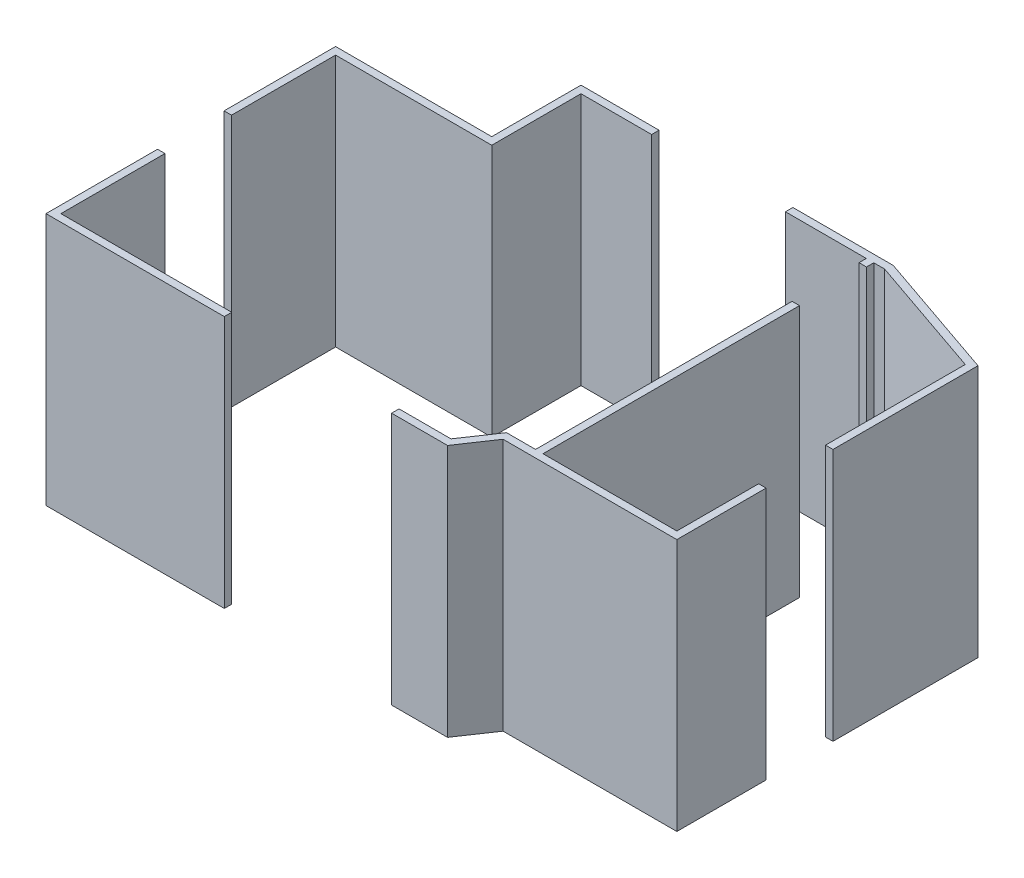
ISO-10303-21;
HEADER;
FILE_DESCRIPTION(('STEP AP214'),'2;1');
FILE_NAME('part.step','',(''),(''),'','','');
FILE_SCHEMA(('AUTOMOTIVE_DESIGN { 1 0 10303 214 1 1 1 1 }'));
ENDSEC;
DATA;
#1=APPLICATION_CONTEXT('core data for automotive mechanical design processes');
#2=APPLICATION_PROTOCOL_DEFINITION('international standard','automotive_design',2000,#1);
#3=PRODUCT_CONTEXT('',#1,'mechanical');
#4=PRODUCT('Part','Part','',(#3));
#5=PRODUCT_RELATED_PRODUCT_CATEGORY('part','',(#4));
#6=PRODUCT_DEFINITION_FORMATION('','',#4);
#7=PRODUCT_DEFINITION_CONTEXT('part definition',#1,'design');
#8=PRODUCT_DEFINITION('design','',#6,#7);
#9=PRODUCT_DEFINITION_SHAPE('','',#8);
#10=(LENGTH_UNIT() NAMED_UNIT(*) SI_UNIT(.MILLI.,.METRE.));
#11=(NAMED_UNIT(*) PLANE_ANGLE_UNIT() SI_UNIT($,.RADIAN.));
#12=(NAMED_UNIT(*) SI_UNIT($,.STERADIAN.) SOLID_ANGLE_UNIT());
#13=UNCERTAINTY_MEASURE_WITH_UNIT(LENGTH_MEASURE(1.E-05),#10,'distance_accuracy_value','');
#14=(GEOMETRIC_REPRESENTATION_CONTEXT(3) GLOBAL_UNCERTAINTY_ASSIGNED_CONTEXT((#13)) GLOBAL_UNIT_ASSIGNED_CONTEXT((#10,
#11,#12)) REPRESENTATION_CONTEXT('',''));
#15=CARTESIAN_POINT('',(0.,0.,0.));
#16=DIRECTION('',(0.,0.,1.));
#17=DIRECTION('',(1.,0.,0.));
#18=AXIS2_PLACEMENT_3D('',#15,#16,#17);
#19=CARTESIAN_POINT('',(0.,2997.2,0.));
#20=DIRECTION('',(1.,0.,0.));
#21=DIRECTION('',(0.,0.,-1.));
#22=AXIS2_PLACEMENT_3D('',#19,#20,#21);
#23=PLANE('',#22);
#24=DIRECTION('',(0.,-1.,0.));
#25=VECTOR('',#24,1.);
#26=CARTESIAN_POINT('',(0.,2997.2,-1524.));
#27=LINE('',#26,#25);
#28=CARTESIAN_POINT('',(0.,2997.2,-1524.));
#29=VERTEX_POINT('',#28);
#30=CARTESIAN_POINT('',(0.,-457.2,-1524.));
#31=VERTEX_POINT('',#30);
#32=EDGE_CURVE('E128',#29,#31,#27,.T.);
#33=ORIENTED_EDGE('',*,*,#32,.T.);
#34=DIRECTION('',(0.,0.,1.));
#35=VECTOR('',#34,1.);
#36=CARTESIAN_POINT('',(0.,-457.2,-1524.));
#37=LINE('',#36,#35);
#38=CARTESIAN_POINT('',(0.,-457.2,0.));
#39=VERTEX_POINT('',#38);
#40=EDGE_CURVE('E120',#31,#39,#37,.T.);
#41=ORIENTED_EDGE('',*,*,#40,.T.);
#42=DIRECTION('',(0.,-1.,0.));
#43=VECTOR('',#42,1.);
#44=CARTESIAN_POINT('',(0.,2997.2,0.));
#45=LINE('',#44,#43);
#46=CARTESIAN_POINT('',(0.,2997.2,0.));
#47=VERTEX_POINT('',#46);
#48=EDGE_CURVE('E106',#47,#39,#45,.T.);
#49=ORIENTED_EDGE('',*,*,#48,.F.);
#50=DIRECTION('',(0.,0.,1.));
#51=VECTOR('',#50,1.);
#52=CARTESIAN_POINT('',(0.,2997.2,0.));
#53=LINE('',#52,#51);
#54=EDGE_CURVE('E146',#29,#47,#53,.T.);
#55=ORIENTED_EDGE('',*,*,#54,.F.);
#56=EDGE_LOOP('',(#33,#41,#49,#55));
#57=FACE_BOUND('',#56,.T.);
#58=ADVANCED_FACE('F53',(#57),#23,.F.);
#59=CARTESIAN_POINT('',(0.,2997.2,0.));
#60=DIRECTION('',(0.,0.,-1.));
#61=DIRECTION('',(-1.,0.,0.));
#62=AXIS2_PLACEMENT_3D('',#59,#60,#61);
#63=PLANE('',#62);
#64=DIRECTION('',(0.,-1.,0.));
#65=VECTOR('',#64,1.);
#66=CARTESIAN_POINT('',(2435.961,2997.2,0.));
#67=LINE('',#66,#65);
#68=CARTESIAN_POINT('',(2435.961,2997.2,0.));
#69=VERTEX_POINT('',#68);
#70=CARTESIAN_POINT('',(2435.961,-457.2,0.));
#71=VERTEX_POINT('',#70);
#72=EDGE_CURVE('E113',#69,#71,#67,.T.);
#73=ORIENTED_EDGE('',*,*,#72,.F.);
#74=DIRECTION('',(-1.,0.,0.));
#75=VECTOR('',#74,1.);
#76=CARTESIAN_POINT('',(0.,2997.2,0.));
#77=LINE('',#76,#75);
#78=EDGE_CURVE('E70',#69,#47,#77,.T.);
#79=ORIENTED_EDGE('',*,*,#78,.T.);
#80=ORIENTED_EDGE('',*,*,#48,.T.);
#81=DIRECTION('',(1.,0.,0.));
#82=VECTOR('',#81,1.);
#83=CARTESIAN_POINT('',(0.,-457.2,0.));
#84=LINE('',#83,#82);
#85=EDGE_CURVE('E108',#39,#71,#84,.T.);
#86=ORIENTED_EDGE('',*,*,#85,.T.);
#87=EDGE_LOOP('',(#73,#79,#80,#86));
#88=FACE_BOUND('',#87,.T.);
#89=ADVANCED_FACE('F55',(#88),#63,.F.);
#90=CARTESIAN_POINT('',(2435.961,2997.2,-101.6));
#91=DIRECTION('',(-1.,0.,0.));
#92=DIRECTION('',(0.,0.,1.));
#93=AXIS2_PLACEMENT_3D('',#90,#91,#92);
#94=PLANE('',#93);
#95=ORIENTED_EDGE('',*,*,#72,.T.);
#96=DIRECTION('',(0.,0.,-1.));
#97=VECTOR('',#96,1.);
#98=CARTESIAN_POINT('',(2435.961,-457.2,0.));
#99=LINE('',#98,#97);
#100=CARTESIAN_POINT('',(2435.961,-457.2,-101.6));
#101=VERTEX_POINT('',#100);
#102=EDGE_CURVE('E124',#71,#101,#99,.T.);
#103=ORIENTED_EDGE('',*,*,#102,.T.);
#104=DIRECTION('',(0.,-1.,0.));
#105=VECTOR('',#104,1.);
#106=CARTESIAN_POINT('',(2435.961,2997.2,-101.6));
#107=LINE('',#106,#105);
#108=CARTESIAN_POINT('',(2435.961,2997.2,-101.6));
#109=VERTEX_POINT('',#108);
#110=EDGE_CURVE('E150',#109,#101,#107,.T.);
#111=ORIENTED_EDGE('',*,*,#110,.F.);
#112=DIRECTION('',(0.,0.,-1.));
#113=VECTOR('',#112,1.);
#114=CARTESIAN_POINT('',(2435.961,2997.2,-101.6));
#115=LINE('',#114,#113);
#116=EDGE_CURVE('E144',#69,#109,#115,.T.);
#117=ORIENTED_EDGE('',*,*,#116,.F.);
#118=EDGE_LOOP('',(#95,#103,#111,#117));
#119=FACE_BOUND('',#118,.T.);
#120=ADVANCED_FACE('F179',(#119),#94,.F.);
#121=CARTESIAN_POINT('',(101.6,2997.2,-101.6));
#122=DIRECTION('',(0.,0.,1.));
#123=DIRECTION('',(1.,0.,0.));
#124=AXIS2_PLACEMENT_3D('',#121,#122,#123);
#125=PLANE('',#124);
#126=ORIENTED_EDGE('',*,*,#110,.T.);
#127=DIRECTION('',(-1.,0.,0.));
#128=VECTOR('',#127,1.);
#129=CARTESIAN_POINT('',(2435.961,-457.2,-101.6));
#130=LINE('',#129,#128);
#131=CARTESIAN_POINT('',(101.6,-457.2,-101.6));
#132=VERTEX_POINT('',#131);
#133=EDGE_CURVE('E133',#101,#132,#130,.T.);
#134=ORIENTED_EDGE('',*,*,#133,.T.);
#135=DIRECTION('',(0.,-1.,0.));
#136=VECTOR('',#135,1.);
#137=CARTESIAN_POINT('',(101.6,2997.2,-101.6));
#138=LINE('',#137,#136);
#139=CARTESIAN_POINT('',(101.6,2997.2,-101.6));
#140=VERTEX_POINT('',#139);
#141=EDGE_CURVE('E154',#140,#132,#138,.T.);
#142=ORIENTED_EDGE('',*,*,#141,.F.);
#143=DIRECTION('',(-1.,0.,0.));
#144=VECTOR('',#143,1.);
#145=CARTESIAN_POINT('',(101.6,2997.2,-101.6));
#146=LINE('',#145,#144);
#147=EDGE_CURVE('E63',#109,#140,#146,.T.);
#148=ORIENTED_EDGE('',*,*,#147,.F.);
#149=EDGE_LOOP('',(#126,#134,#142,#148));
#150=FACE_BOUND('',#149,.T.);
#151=ADVANCED_FACE('F174',(#150),#125,.F.);
#152=CARTESIAN_POINT('',(101.6,2997.2,-101.6));
#153=DIRECTION('',(-1.,0.,0.));
#154=DIRECTION('',(0.,0.,1.));
#155=AXIS2_PLACEMENT_3D('',#152,#153,#154);
#156=PLANE('',#155);
#157=ORIENTED_EDGE('',*,*,#141,.T.);
#158=DIRECTION('',(0.,0.,-1.));
#159=VECTOR('',#158,1.);
#160=CARTESIAN_POINT('',(101.6,-457.2,-101.6));
#161=LINE('',#160,#159);
#162=CARTESIAN_POINT('',(101.6,-457.2,-1524.));
#163=VERTEX_POINT('',#162);
#164=EDGE_CURVE('E137',#132,#163,#161,.T.);
#165=ORIENTED_EDGE('',*,*,#164,.T.);
#166=DIRECTION('',(0.,-1.,0.));
#167=VECTOR('',#166,1.);
#168=CARTESIAN_POINT('',(101.6,2997.2,-1524.));
#169=LINE('',#168,#167);
#170=CARTESIAN_POINT('',(101.6,2997.2,-1524.));
#171=VERTEX_POINT('',#170);
#172=EDGE_CURVE('E157',#171,#163,#169,.T.);
#173=ORIENTED_EDGE('',*,*,#172,.F.);
#174=DIRECTION('',(0.,0.,-1.));
#175=VECTOR('',#174,1.);
#176=CARTESIAN_POINT('',(101.6,2997.2,-101.6));
#177=LINE('',#176,#175);
#178=EDGE_CURVE('E12',#140,#171,#177,.T.);
#179=ORIENTED_EDGE('',*,*,#178,.F.);
#180=EDGE_LOOP('',(#157,#165,#173,#179));
#181=FACE_BOUND('',#180,.T.);
#182=ADVANCED_FACE('F186',(#181),#156,.F.);
#183=CARTESIAN_POINT('',(101.6,2997.2,-1524.));
#184=DIRECTION('',(0.,0.,1.));
#185=DIRECTION('',(1.,0.,0.));
#186=AXIS2_PLACEMENT_3D('',#183,#184,#185);
#187=PLANE('',#186);
#188=ORIENTED_EDGE('',*,*,#172,.T.);
#189=DIRECTION('',(-1.,0.,0.));
#190=VECTOR('',#189,1.);
#191=CARTESIAN_POINT('',(101.6,-457.2,-1524.));
#192=LINE('',#191,#190);
#193=EDGE_CURVE('E140',#163,#31,#192,.T.);
#194=ORIENTED_EDGE('',*,*,#193,.T.);
#195=ORIENTED_EDGE('',*,*,#32,.F.);
#196=DIRECTION('',(-1.,0.,0.));
#197=VECTOR('',#196,1.);
#198=CARTESIAN_POINT('',(101.6,2997.2,-1524.));
#199=LINE('',#198,#197);
#200=EDGE_CURVE('E160',#171,#29,#199,.T.);
#201=ORIENTED_EDGE('',*,*,#200,.F.);
#202=EDGE_LOOP('',(#188,#194,#195,#201));
#203=FACE_BOUND('',#202,.T.);
#204=ADVANCED_FACE('F169',(#203),#187,.F.);
#205=CARTESIAN_POINT('',(0.,2997.2,-1524.));
#206=DIRECTION('',(0.,1.,0.));
#207=DIRECTION('',(0.,0.,1.));
#208=AXIS2_PLACEMENT_3D('',#205,#206,#207);
#209=PLANE('',#208);
#210=ORIENTED_EDGE('',*,*,#54,.T.);
#211=ORIENTED_EDGE('',*,*,#78,.F.);
#212=ORIENTED_EDGE('',*,*,#116,.T.);
#213=ORIENTED_EDGE('',*,*,#147,.T.);
#214=ORIENTED_EDGE('',*,*,#178,.T.);
#215=ORIENTED_EDGE('',*,*,#200,.T.);
#216=EDGE_LOOP('',(#210,#211,#212,#213,#214,#215));
#217=FACE_BOUND('',#216,.T.);
#218=ADVANCED_FACE('F165',(#217),#209,.T.);
#219=CARTESIAN_POINT('',(0.,-457.2,0.));
#220=DIRECTION('',(0.,1.,0.));
#221=DIRECTION('',(0.,0.,1.));
#222=AXIS2_PLACEMENT_3D('',#219,#220,#221);
#223=PLANE('',#222);
#224=ORIENTED_EDGE('',*,*,#40,.F.);
#225=ORIENTED_EDGE('',*,*,#193,.F.);
#226=ORIENTED_EDGE('',*,*,#164,.F.);
#227=ORIENTED_EDGE('',*,*,#133,.F.);
#228=ORIENTED_EDGE('',*,*,#102,.F.);
#229=ORIENTED_EDGE('',*,*,#85,.F.);
#230=EDGE_LOOP('',(#224,#225,#226,#227,#228,#229));
#231=FACE_BOUND('',#230,.T.);
#232=ADVANCED_FACE('F118',(#231),#223,.F.);
#233=CLOSED_SHELL('',(#58,#89,#120,#151,#182,#204,#218,#232));
#234=MANIFOLD_SOLID_BREP('B2',#233);
#235=CARTESIAN_POINT('',(3201.08661579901,2997.2,-5073.74060592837));
#236=DIRECTION('',(0.,0.,-1.));
#237=DIRECTION('',(-1.,0.,0.));
#238=AXIS2_PLACEMENT_3D('',#235,#236,#237);
#239=PLANE('',#238);
#240=DIRECTION('',(0.,-1.,0.));
#241=VECTOR('',#240,1.);
#242=CARTESIAN_POINT('',(2235.88661579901,2997.2,-5073.74060592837));
#243=LINE('',#242,#241);
#244=CARTESIAN_POINT('',(2235.88661579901,2997.2,-5073.74060592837));
#245=VERTEX_POINT('',#244);
#246=CARTESIAN_POINT('',(2235.88661579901,-457.2,-5073.74060592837));
#247=VERTEX_POINT('',#246);
#248=EDGE_CURVE('E344',#245,#247,#243,.T.);
#249=ORIENTED_EDGE('',*,*,#248,.T.);
#250=DIRECTION('',(1.,0.,0.));
#251=VECTOR('',#250,1.);
#252=CARTESIAN_POINT('',(2235.88661579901,-457.2,-5073.74060592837));
#253=LINE('',#252,#251);
#254=CARTESIAN_POINT('',(3201.08661579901,-457.2,-5073.74060592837));
#255=VERTEX_POINT('',#254);
#256=EDGE_CURVE('E421',#247,#255,#253,.T.);
#257=ORIENTED_EDGE('',*,*,#256,.T.);
#258=DIRECTION('',(0.,-1.,0.));
#259=VECTOR('',#258,1.);
#260=CARTESIAN_POINT('',(3201.08661579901,2997.2,-5073.74060592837));
#261=LINE('',#260,#259);
#262=CARTESIAN_POINT('',(3201.08661579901,2997.2,-5073.74060592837));
#263=VERTEX_POINT('',#262);
#264=EDGE_CURVE('E357',#263,#255,#261,.T.);
#265=ORIENTED_EDGE('',*,*,#264,.F.);
#266=DIRECTION('',(1.,0.,0.));
#267=VECTOR('',#266,1.);
#268=CARTESIAN_POINT('',(3201.08661579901,2997.2,-5073.74060592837));
#269=LINE('',#268,#267);
#270=EDGE_CURVE('E300',#245,#263,#269,.T.);
#271=ORIENTED_EDGE('',*,*,#270,.F.);
#272=EDGE_LOOP('',(#249,#257,#265,#271));
#273=FACE_BOUND('',#272,.T.);
#274=ADVANCED_FACE('F290',(#273),#239,.F.);
#275=CARTESIAN_POINT('',(2235.88661579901,2997.2,-5073.74060592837));
#276=DIRECTION('',(-1.,0.,0.));
#277=DIRECTION('',(0.,0.,1.));
#278=AXIS2_PLACEMENT_3D('',#275,#276,#277);
#279=PLANE('',#278);
#280=DIRECTION('',(0.,-1.,0.));
#281=VECTOR('',#280,1.);
#282=CARTESIAN_POINT('',(2235.88661579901,2997.2,-3854.54060592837));
#283=LINE('',#282,#281);
#284=CARTESIAN_POINT('',(2235.88661579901,2997.2,-3854.54060592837));
#285=VERTEX_POINT('',#284);
#286=CARTESIAN_POINT('',(2235.88661579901,-457.2,-3854.54060592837));
#287=VERTEX_POINT('',#286);
#288=EDGE_CURVE('E353',#285,#287,#283,.T.);
#289=ORIENTED_EDGE('',*,*,#288,.T.);
#290=DIRECTION('',(0.,0.,-1.));
#291=VECTOR('',#290,1.);
#292=CARTESIAN_POINT('',(2235.88661579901,-457.2,-3854.54060592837));
#293=LINE('',#292,#291);
#294=EDGE_CURVE('E348',#287,#247,#293,.T.);
#295=ORIENTED_EDGE('',*,*,#294,.T.);
#296=ORIENTED_EDGE('',*,*,#248,.F.);
#297=DIRECTION('',(0.,0.,-1.));
#298=VECTOR('',#297,1.);
#299=CARTESIAN_POINT('',(2235.88661579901,2997.2,-5073.74060592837));
#300=LINE('',#299,#298);
#301=EDGE_CURVE('E334',#285,#245,#300,.T.);
#302=ORIENTED_EDGE('',*,*,#301,.F.);
#303=EDGE_LOOP('',(#289,#295,#296,#302));
#304=FACE_BOUND('',#303,.T.);
#305=ADVANCED_FACE('F345',(#304),#279,.F.);
#306=CARTESIAN_POINT('',(2235.88661579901,2997.2,-3854.54060592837));
#307=DIRECTION('',(0.,0.,-1.));
#308=DIRECTION('',(-1.,0.,0.));
#309=AXIS2_PLACEMENT_3D('',#306,#307,#308);
#310=PLANE('',#309);
#311=DIRECTION('',(0.,-1.,0.));
#312=VECTOR('',#311,1.);
#313=CARTESIAN_POINT('',(102.286615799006,2997.2,-3854.54060592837));
#314=LINE('',#313,#312);
#315=CARTESIAN_POINT('',(102.286615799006,2997.2,-3854.54060592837));
#316=VERTEX_POINT('',#315);
#317=CARTESIAN_POINT('',(102.286615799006,-457.2,-3854.54060592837));
#318=VERTEX_POINT('',#317);
#319=EDGE_CURVE('E405',#316,#318,#314,.T.);
#320=ORIENTED_EDGE('',*,*,#319,.T.);
#321=DIRECTION('',(1.,0.,0.));
#322=VECTOR('',#321,1.);
#323=CARTESIAN_POINT('',(102.286615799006,-457.2,-3854.54060592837));
#324=LINE('',#323,#322);
#325=EDGE_CURVE('E419',#318,#287,#324,.T.);
#326=ORIENTED_EDGE('',*,*,#325,.T.);
#327=ORIENTED_EDGE('',*,*,#288,.F.);
#328=DIRECTION('',(1.,0.,0.));
#329=VECTOR('',#328,1.);
#330=CARTESIAN_POINT('',(2235.88661579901,2997.2,-3854.54060592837));
#331=LINE('',#330,#329);
#332=EDGE_CURVE('E337',#316,#285,#331,.T.);
#333=ORIENTED_EDGE('',*,*,#332,.F.);
#334=EDGE_LOOP('',(#320,#326,#327,#333));
#335=FACE_BOUND('',#334,.T.);
#336=ADVANCED_FACE('F424',(#335),#310,.F.);
#337=CARTESIAN_POINT('',(102.286615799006,2997.2,-3854.54060592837));
#338=DIRECTION('',(-1.,0.,0.));
#339=DIRECTION('',(0.,0.,1.));
#340=AXIS2_PLACEMENT_3D('',#337,#338,#339);
#341=PLANE('',#340);
#342=DIRECTION('',(0.,-1.,0.));
#343=VECTOR('',#342,1.);
#344=CARTESIAN_POINT('',(102.286615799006,2997.2,-2432.14060592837));
#345=LINE('',#344,#343);
#346=CARTESIAN_POINT('',(102.286615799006,2997.2,-2432.14060592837));
#347=VERTEX_POINT('',#346);
#348=CARTESIAN_POINT('',(102.286615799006,-457.2,-2432.14060592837));
#349=VERTEX_POINT('',#348);
#350=EDGE_CURVE('E398',#347,#349,#345,.T.);
#351=ORIENTED_EDGE('',*,*,#350,.T.);
#352=DIRECTION('',(0.,0.,-1.));
#353=VECTOR('',#352,1.);
#354=CARTESIAN_POINT('',(102.286615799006,-457.2,-2432.14060592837));
#355=LINE('',#354,#353);
#356=EDGE_CURVE('E427',#349,#318,#355,.T.);
#357=ORIENTED_EDGE('',*,*,#356,.T.);
#358=ORIENTED_EDGE('',*,*,#319,.F.);
#359=DIRECTION('',(0.,0.,-1.));
#360=VECTOR('',#359,1.);
#361=CARTESIAN_POINT('',(102.286615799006,2997.2,-3854.54060592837));
#362=LINE('',#361,#360);
#363=EDGE_CURVE('E363',#347,#316,#362,.T.);
#364=ORIENTED_EDGE('',*,*,#363,.F.);
#365=EDGE_LOOP('',(#351,#357,#358,#364));
#366=FACE_BOUND('',#365,.T.);
#367=ADVANCED_FACE('F525',(#366),#341,.F.);
#368=CARTESIAN_POINT('',(0.686615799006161,2997.2,-2432.14060592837));
#369=DIRECTION('',(0.,0.,-1.));
#370=DIRECTION('',(-1.,0.,0.));
#371=AXIS2_PLACEMENT_3D('',#368,#369,#370);
#372=PLANE('',#371);
#373=DIRECTION('',(0.,-1.,0.));
#374=VECTOR('',#373,1.);
#375=CARTESIAN_POINT('',(0.686615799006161,2997.2,-2432.14060592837));
#376=LINE('',#375,#374);
#377=CARTESIAN_POINT('',(0.686615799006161,2997.2,-2432.14060592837));
#378=VERTEX_POINT('',#377);
#379=CARTESIAN_POINT('',(0.686615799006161,-457.2,-2432.14060592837));
#380=VERTEX_POINT('',#379);
#381=EDGE_CURVE('E390',#378,#380,#376,.T.);
#382=ORIENTED_EDGE('',*,*,#381,.T.);
#383=DIRECTION('',(1.,0.,0.));
#384=VECTOR('',#383,1.);
#385=CARTESIAN_POINT('',(0.686615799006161,-457.2,-2432.14060592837));
#386=LINE('',#385,#384);
#387=EDGE_CURVE('E430',#380,#349,#386,.T.);
#388=ORIENTED_EDGE('',*,*,#387,.T.);
#389=ORIENTED_EDGE('',*,*,#350,.F.);
#390=DIRECTION('',(1.,0.,0.));
#391=VECTOR('',#390,1.);
#392=CARTESIAN_POINT('',(0.686615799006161,2997.2,-2432.14060592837));
#393=LINE('',#392,#391);
#394=EDGE_CURVE('E365',#378,#347,#393,.T.);
#395=ORIENTED_EDGE('',*,*,#394,.F.);
#396=EDGE_LOOP('',(#382,#388,#389,#395));
#397=FACE_BOUND('',#396,.T.);
#398=ADVANCED_FACE('F475',(#397),#372,.F.);
#399=CARTESIAN_POINT('',(0.686615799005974,2997.2,-3956.14060592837));
#400=DIRECTION('',(1.,0.,0.));
#401=DIRECTION('',(0.,0.,-1.));
#402=AXIS2_PLACEMENT_3D('',#399,#400,#401);
#403=PLANE('',#402);
#404=DIRECTION('',(0.,-1.,0.));
#405=VECTOR('',#404,1.);
#406=CARTESIAN_POINT('',(0.686615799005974,2997.2,-3956.14060592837));
#407=LINE('',#406,#405);
#408=CARTESIAN_POINT('',(0.686615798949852,2997.2,-3956.14060528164));
#409=VERTEX_POINT('',#408);
#410=CARTESIAN_POINT('',(0.686615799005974,-457.2,-3956.14060592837));
#411=VERTEX_POINT('',#410);
#412=EDGE_CURVE('E383',#409,#411,#407,.T.);
#413=ORIENTED_EDGE('',*,*,#412,.T.);
#414=DIRECTION('',(0.,0.,1.));
#415=VECTOR('',#414,1.);
#416=CARTESIAN_POINT('',(0.686615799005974,-457.2,-3956.14060592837));
#417=LINE('',#416,#415);
#418=EDGE_CURVE('E631',#411,#380,#417,.T.);
#419=ORIENTED_EDGE('',*,*,#418,.T.);
#420=ORIENTED_EDGE('',*,*,#381,.F.);
#421=DIRECTION('',(0.,0.,1.));
#422=VECTOR('',#421,1.);
#423=CARTESIAN_POINT('',(0.686615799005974,2997.2,-3956.14060592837));
#424=LINE('',#423,#422);
#425=EDGE_CURVE('E367',#409,#378,#424,.T.);
#426=ORIENTED_EDGE('',*,*,#425,.F.);
#427=EDGE_LOOP('',(#413,#419,#420,#426));
#428=FACE_BOUND('',#427,.T.);
#429=ADVANCED_FACE('F467',(#428),#403,.F.);
#430=CARTESIAN_POINT('',(3201.08661579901,2997.2,-5175.34060592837));
#431=DIRECTION('',(-1.,0.,0.));
#432=DIRECTION('',(0.,0.,1.));
#433=AXIS2_PLACEMENT_3D('',#430,#431,#432);
#434=PLANE('',#433);
#435=ORIENTED_EDGE('',*,*,#264,.T.);
#436=DIRECTION('',(0.,0.,-1.));
#437=VECTOR('',#436,1.);
#438=CARTESIAN_POINT('',(3201.08661579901,-457.2,-5073.74060592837));
#439=LINE('',#438,#437);
#440=CARTESIAN_POINT('',(3201.08661579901,-457.2,-5175.34060592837));
#441=VERTEX_POINT('',#440);
#442=EDGE_CURVE('E436',#255,#441,#439,.T.);
#443=ORIENTED_EDGE('',*,*,#442,.T.);
#444=DIRECTION('',(0.,-1.,0.));
#445=VECTOR('',#444,1.);
#446=CARTESIAN_POINT('',(3201.08661579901,2997.2,-5175.34060592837));
#447=LINE('',#446,#445);
#448=CARTESIAN_POINT('',(3201.08661579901,2997.2,-5175.34060592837));
#449=VERTEX_POINT('',#448);
#450=EDGE_CURVE('E368',#449,#441,#447,.T.);
#451=ORIENTED_EDGE('',*,*,#450,.F.);
#452=DIRECTION('',(0.,0.,-1.));
#453=VECTOR('',#452,1.);
#454=CARTESIAN_POINT('',(3201.08661579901,2997.2,-5175.34060592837));
#455=LINE('',#454,#453);
#456=EDGE_CURVE('E51',#263,#449,#455,.T.);
#457=ORIENTED_EDGE('',*,*,#456,.F.);
#458=EDGE_LOOP('',(#435,#443,#451,#457));
#459=FACE_BOUND('',#458,.T.);
#460=ADVANCED_FACE('F464',(#459),#434,.F.);
#461=CARTESIAN_POINT('',(0.686615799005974,3098.8,-3956.14060592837));
#462=DIRECTION('',(0.,0.,1.));
#463=DIRECTION('',(1.,0.,0.));
#464=AXIS2_PLACEMENT_3D('',#461,#462,#463);
#465=PLANE('',#464);
#466=ORIENTED_EDGE('',*,*,#412,.F.);
#467=DIRECTION('',(1.,0.,0.));
#468=VECTOR('',#467,1.);
#469=CARTESIAN_POINT('',(0.686615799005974,2997.2,-3956.14060592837));
#470=LINE('',#469,#468);
#471=CARTESIAN_POINT('',(2134.28661579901,2997.2,-3956.14060592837));
#472=VERTEX_POINT('',#471);
#473=EDGE_CURVE('E373',#409,#472,#470,.T.);
#474=ORIENTED_EDGE('',*,*,#473,.T.);
#475=DIRECTION('',(0.,-1.,0.));
#476=VECTOR('',#475,1.);
#477=CARTESIAN_POINT('',(2134.28661579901,3098.8,-3956.14060592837));
#478=LINE('',#477,#476);
#479=CARTESIAN_POINT('',(2134.28661579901,-457.2,-3956.14060592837));
#480=VERTEX_POINT('',#479);
#481=EDGE_CURVE('E372',#472,#480,#478,.T.);
#482=ORIENTED_EDGE('',*,*,#481,.T.);
#483=DIRECTION('',(-1.,0.,0.));
#484=VECTOR('',#483,1.);
#485=CARTESIAN_POINT('',(2134.28661579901,-457.2,-3956.14060592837));
#486=LINE('',#485,#484);
#487=EDGE_CURVE('E354',#480,#411,#486,.T.);
#488=ORIENTED_EDGE('',*,*,#487,.T.);
#489=EDGE_LOOP('',(#466,#474,#482,#488));
#490=FACE_BOUND('',#489,.T.);
#491=ADVANCED_FACE('F466',(#490),#465,.F.);
#492=CARTESIAN_POINT('',(2134.28661579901,3098.8,-3956.14060592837));
#493=DIRECTION('',(1.,0.,0.));
#494=DIRECTION('',(0.,0.,-1.));
#495=AXIS2_PLACEMENT_3D('',#492,#493,#494);
#496=PLANE('',#495);
#497=ORIENTED_EDGE('',*,*,#481,.F.);
#498=DIRECTION('',(0.,0.,-1.));
#499=VECTOR('',#498,1.);
#500=CARTESIAN_POINT('',(2134.28661579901,2997.2,-3956.14060592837));
#501=LINE('',#500,#499);
#502=CARTESIAN_POINT('',(2134.28661579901,2997.2,-5175.34060592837));
#503=VERTEX_POINT('',#502);
#504=EDGE_CURVE('E370',#472,#503,#501,.T.);
#505=ORIENTED_EDGE('',*,*,#504,.T.);
#506=DIRECTION('',(0.,-1.,0.));
#507=VECTOR('',#506,1.);
#508=CARTESIAN_POINT('',(2134.28661579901,3098.8,-5175.34060592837));
#509=LINE('',#508,#507);
#510=CARTESIAN_POINT('',(2134.28661579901,-457.2,-5175.34060592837));
#511=VERTEX_POINT('',#510);
#512=EDGE_CURVE('E371',#503,#511,#509,.T.);
#513=ORIENTED_EDGE('',*,*,#512,.T.);
#514=DIRECTION('',(0.,0.,1.));
#515=VECTOR('',#514,1.);
#516=CARTESIAN_POINT('',(2134.28661579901,-457.2,-5175.34060592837));
#517=LINE('',#516,#515);
#518=EDGE_CURVE('E443',#511,#480,#517,.T.);
#519=ORIENTED_EDGE('',*,*,#518,.T.);
#520=EDGE_LOOP('',(#497,#505,#513,#519));
#521=FACE_BOUND('',#520,.T.);
#522=ADVANCED_FACE('F473',(#521),#496,.F.);
#523=CARTESIAN_POINT('',(2134.28661579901,3098.8,-5175.34060592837));
#524=DIRECTION('',(0.,0.,1.));
#525=DIRECTION('',(1.,0.,0.));
#526=AXIS2_PLACEMENT_3D('',#523,#524,#525);
#527=PLANE('',#526);
#528=ORIENTED_EDGE('',*,*,#512,.F.);
#529=DIRECTION('',(1.,0.,0.));
#530=VECTOR('',#529,1.);
#531=CARTESIAN_POINT('',(2134.28661579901,2997.2,-5175.34060592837));
#532=LINE('',#531,#530);
#533=EDGE_CURVE('E294',#503,#449,#532,.T.);
#534=ORIENTED_EDGE('',*,*,#533,.T.);
#535=ORIENTED_EDGE('',*,*,#450,.T.);
#536=DIRECTION('',(-1.,0.,0.));
#537=VECTOR('',#536,1.);
#538=CARTESIAN_POINT('',(3201.08661579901,-457.2,-5175.34060592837));
#539=LINE('',#538,#537);
#540=EDGE_CURVE('E439',#441,#511,#539,.T.);
#541=ORIENTED_EDGE('',*,*,#540,.T.);
#542=EDGE_LOOP('',(#528,#534,#535,#541));
#543=FACE_BOUND('',#542,.T.);
#544=ADVANCED_FACE('F460',(#543),#527,.F.);
#545=CARTESIAN_POINT('',(8166.63686224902,2997.2,221.151266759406));
#546=DIRECTION('',(0.,-1.,0.));
#547=DIRECTION('',(0.,0.,-1.));
#548=AXIS2_PLACEMENT_3D('',#545,#546,#547);
#549=PLANE('',#548);
#550=ORIENTED_EDGE('',*,*,#504,.F.);
#551=ORIENTED_EDGE('',*,*,#473,.F.);
#552=ORIENTED_EDGE('',*,*,#425,.T.);
#553=ORIENTED_EDGE('',*,*,#394,.T.);
#554=ORIENTED_EDGE('',*,*,#363,.T.);
#555=ORIENTED_EDGE('',*,*,#332,.T.);
#556=ORIENTED_EDGE('',*,*,#301,.T.);
#557=ORIENTED_EDGE('',*,*,#270,.T.);
#558=ORIENTED_EDGE('',*,*,#456,.T.);
#559=ORIENTED_EDGE('',*,*,#533,.F.);
#560=EDGE_LOOP('',(#550,#551,#552,#553,#554,#555,#556,#557,#558,#559));
#561=FACE_BOUND('',#560,.T.);
#562=ADVANCED_FACE('F292',(#561),#549,.F.);
#563=CARTESIAN_POINT('',(0.686615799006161,-457.2,-2432.14060592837));
#564=DIRECTION('',(0.,1.,0.));
#565=DIRECTION('',(0.,0.,1.));
#566=AXIS2_PLACEMENT_3D('',#563,#564,#565);
#567=PLANE('',#566);
#568=ORIENTED_EDGE('',*,*,#418,.F.);
#569=ORIENTED_EDGE('',*,*,#487,.F.);
#570=ORIENTED_EDGE('',*,*,#518,.F.);
#571=ORIENTED_EDGE('',*,*,#540,.F.);
#572=ORIENTED_EDGE('',*,*,#442,.F.);
#573=ORIENTED_EDGE('',*,*,#256,.F.);
#574=ORIENTED_EDGE('',*,*,#294,.F.);
#575=ORIENTED_EDGE('',*,*,#325,.F.);
#576=ORIENTED_EDGE('',*,*,#356,.F.);
#577=ORIENTED_EDGE('',*,*,#387,.F.);
#578=EDGE_LOOP('',(#568,#569,#570,#571,#572,#573,#574,#575,#576,#577));
#579=FACE_BOUND('',#578,.T.);
#580=ADVANCED_FACE('F417',(#579),#567,.F.);
#581=CLOSED_SHELL('',(#274,#305,#336,#367,#398,#429,#460,#491,#522,#544,#562,#580));
#582=MANIFOLD_SOLID_BREP('B6',#581);
#583=CARTESIAN_POINT('',(8065.07524458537,2997.2,-2586.33741837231));
#584=DIRECTION('',(1.,0.,0.));
#585=DIRECTION('',(0.,0.,-1.));
#586=AXIS2_PLACEMENT_3D('',#583,#584,#585);
#587=PLANE('',#586);
#588=DIRECTION('',(0.,-1.,0.));
#589=VECTOR('',#588,1.);
#590=CARTESIAN_POINT('',(8065.07524458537,2997.2,-4495.06684267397));
#591=LINE('',#590,#589);
#592=CARTESIAN_POINT('',(8065.07524458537,2997.2,-4495.06684267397));
#593=VERTEX_POINT('',#592);
#594=CARTESIAN_POINT('',(8065.07524458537,-457.2,-4495.06684267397));
#595=VERTEX_POINT('',#594);
#596=EDGE_CURVE('E752',#593,#595,#591,.T.);
#597=ORIENTED_EDGE('',*,*,#596,.T.);
#598=DIRECTION('',(0.,0.,1.));
#599=VECTOR('',#598,1.);
#600=CARTESIAN_POINT('',(8065.07524458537,-457.2,-4495.06684267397));
#601=LINE('',#600,#599);
#602=CARTESIAN_POINT('',(8065.07524458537,-457.2,-2586.33741837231));
#603=VERTEX_POINT('',#602);
#604=EDGE_CURVE('E785',#595,#603,#601,.T.);
#605=ORIENTED_EDGE('',*,*,#604,.T.);
#606=DIRECTION('',(0.,-1.,0.));
#607=VECTOR('',#606,1.);
#608=CARTESIAN_POINT('',(8065.07524458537,2997.2,-2586.33741837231));
#609=LINE('',#608,#607);
#610=CARTESIAN_POINT('',(8065.07524458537,2997.2,-2586.33741837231));
#611=VERTEX_POINT('',#610);
#612=EDGE_CURVE('E712',#611,#603,#609,.T.);
#613=ORIENTED_EDGE('',*,*,#612,.F.);
#614=DIRECTION('',(0.,0.,1.));
#615=VECTOR('',#614,1.);
#616=CARTESIAN_POINT('',(8065.07524458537,2997.2,-2586.33741837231));
#617=LINE('',#616,#615);
#618=EDGE_CURVE('E664',#593,#611,#617,.T.);
#619=ORIENTED_EDGE('',*,*,#618,.F.);
#620=EDGE_LOOP('',(#597,#605,#613,#619));
#621=FACE_BOUND('',#620,.T.);
#622=ADVANCED_FACE('F654',(#621),#587,.F.);
#623=CARTESIAN_POINT('',(8065.07524458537,2997.2,-4495.06684267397));
#624=DIRECTION('',(0.325568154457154,0.,-0.945518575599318));
#625=DIRECTION('',(-0.945518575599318,0.,-0.325568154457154));
#626=AXIS2_PLACEMENT_3D('',#623,#624,#625);
#627=PLANE('',#626);
#628=DIRECTION('',(0.,-1.,0.));
#629=VECTOR('',#628,1.);
#630=CARTESIAN_POINT('',(6384.48460671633,2997.2,-5073.74060592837));
#631=LINE('',#630,#629);
#632=CARTESIAN_POINT('',(6384.48460671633,2997.2,-5073.74060592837));
#633=VERTEX_POINT('',#632);
#634=CARTESIAN_POINT('',(6384.48460671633,-457.2,-5073.74060592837));
#635=VERTEX_POINT('',#634);
#636=EDGE_CURVE('E749',#633,#635,#631,.T.);
#637=ORIENTED_EDGE('',*,*,#636,.T.);
#638=DIRECTION('',(0.945518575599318,0.,0.325568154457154));
#639=VECTOR('',#638,1.);
#640=CARTESIAN_POINT('',(6384.48460671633,-457.2,-5073.74060592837));
#641=LINE('',#640,#639);
#642=EDGE_CURVE('E788',#635,#595,#641,.T.);
#643=ORIENTED_EDGE('',*,*,#642,.T.);
#644=ORIENTED_EDGE('',*,*,#596,.F.);
#645=DIRECTION('',(0.945518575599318,0.,0.325568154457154));
#646=VECTOR('',#645,1.);
#647=CARTESIAN_POINT('',(8065.07524458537,2997.2,-4495.06684267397));
#648=LINE('',#647,#646);
#649=EDGE_CURVE('E756',#633,#593,#648,.T.);
#650=ORIENTED_EDGE('',*,*,#649,.F.);
#651=EDGE_LOOP('',(#637,#643,#644,#650));
#652=FACE_BOUND('',#651,.T.);
#653=ADVANCED_FACE('F860',(#652),#627,.F.);
#654=CARTESIAN_POINT('',(6384.48460671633,2997.2,-5073.74060592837));
#655=DIRECTION('',(0.,0.,-1.));
#656=DIRECTION('',(-1.,0.,0.));
#657=AXIS2_PLACEMENT_3D('',#654,#655,#656);
#658=PLANE('',#657);
#659=DIRECTION('',(0.,-1.,0.));
#660=VECTOR('',#659,1.);
#661=CARTESIAN_POINT('',(6236.27524458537,2997.2,-5073.74060592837));
#662=LINE('',#661,#660);
#663=CARTESIAN_POINT('',(6236.27524458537,2997.2,-5073.74060592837));
#664=VERTEX_POINT('',#663);
#665=CARTESIAN_POINT('',(6236.27524458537,-457.2,-5073.74060592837));
#666=VERTEX_POINT('',#665);
#667=EDGE_CURVE('E746',#664,#666,#662,.T.);
#668=ORIENTED_EDGE('',*,*,#667,.T.);
#669=DIRECTION('',(1.,0.,0.));
#670=VECTOR('',#669,1.);
#671=CARTESIAN_POINT('',(6236.27524458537,-457.2,-5073.74060592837));
#672=LINE('',#671,#670);
#673=EDGE_CURVE('E791',#666,#635,#672,.T.);
#674=ORIENTED_EDGE('',*,*,#673,.T.);
#675=ORIENTED_EDGE('',*,*,#636,.F.);
#676=DIRECTION('',(1.,0.,0.));
#677=VECTOR('',#676,1.);
#678=CARTESIAN_POINT('',(6384.48460671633,2997.2,-5073.74060592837));
#679=LINE('',#678,#677);
#680=EDGE_CURVE('E759',#664,#633,#679,.T.);
#681=ORIENTED_EDGE('',*,*,#680,.F.);
#682=EDGE_LOOP('',(#668,#674,#675,#681));
#683=FACE_BOUND('',#682,.T.);
#684=ADVANCED_FACE('F856',(#683),#658,.F.);
#685=CARTESIAN_POINT('',(6236.27524458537,2997.2,-4973.93741837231));
#686=DIRECTION('',(-1.,0.,0.));
#687=DIRECTION('',(0.,0.,1.));
#688=AXIS2_PLACEMENT_3D('',#685,#686,#687);
#689=PLANE('',#688);
#690=DIRECTION('',(0.,-1.,0.));
#691=VECTOR('',#690,1.);
#692=CARTESIAN_POINT('',(6236.27524458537,2997.2,-4973.93741837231));
#693=LINE('',#692,#691);
#694=CARTESIAN_POINT('',(6236.27524458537,2997.2,-4973.93741837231));
#695=VERTEX_POINT('',#694);
#696=CARTESIAN_POINT('',(6236.27524458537,-457.2,-4973.93741837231));
#697=VERTEX_POINT('',#696);
#698=EDGE_CURVE('E743',#695,#697,#693,.T.);
#699=ORIENTED_EDGE('',*,*,#698,.T.);
#700=DIRECTION('',(0.,0.,-1.));
#701=VECTOR('',#700,1.);
#702=CARTESIAN_POINT('',(6236.27524458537,-457.2,-4973.93741837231));
#703=LINE('',#702,#701);
#704=EDGE_CURVE('E794',#697,#666,#703,.T.);
#705=ORIENTED_EDGE('',*,*,#704,.T.);
#706=ORIENTED_EDGE('',*,*,#667,.F.);
#707=DIRECTION('',(0.,0.,-1.));
#708=VECTOR('',#707,1.);
#709=CARTESIAN_POINT('',(6236.27524458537,2997.2,-4973.93741837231));
#710=LINE('',#709,#708);
#711=EDGE_CURVE('E761',#695,#664,#710,.T.);
#712=ORIENTED_EDGE('',*,*,#711,.F.);
#713=EDGE_LOOP('',(#699,#705,#706,#712));
#714=FACE_BOUND('',#713,.T.);
#715=ADVANCED_FACE('F850',(#714),#689,.F.);
#716=CARTESIAN_POINT('',(6134.67524458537,2997.2,-4973.93741837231));
#717=DIRECTION('',(0.,0.,-1.));
#718=DIRECTION('',(-1.,0.,0.));
#719=AXIS2_PLACEMENT_3D('',#716,#717,#718);
#720=PLANE('',#719);
#721=DIRECTION('',(0.,-1.,0.));
#722=VECTOR('',#721,1.);
#723=CARTESIAN_POINT('',(6134.67524458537,2997.2,-4973.93741837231));
#724=LINE('',#723,#722);
#725=CARTESIAN_POINT('',(6134.67524458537,2997.2,-4973.93741837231));
#726=VERTEX_POINT('',#725);
#727=CARTESIAN_POINT('',(6134.67524458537,-457.2,-4973.93741837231));
#728=VERTEX_POINT('',#727);
#729=EDGE_CURVE('E740',#726,#728,#724,.T.);
#730=ORIENTED_EDGE('',*,*,#729,.T.);
#731=DIRECTION('',(1.,0.,0.));
#732=VECTOR('',#731,1.);
#733=CARTESIAN_POINT('',(6134.67524458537,-457.2,-4973.93741837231));
#734=LINE('',#733,#732);
#735=EDGE_CURVE('E797',#728,#697,#734,.T.);
#736=ORIENTED_EDGE('',*,*,#735,.T.);
#737=ORIENTED_EDGE('',*,*,#698,.F.);
#738=DIRECTION('',(1.,0.,0.));
#739=VECTOR('',#738,1.);
#740=CARTESIAN_POINT('',(6134.67524458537,2997.2,-4973.93741837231));
#741=LINE('',#740,#739);
#742=EDGE_CURVE('E763',#726,#695,#741,.T.);
#743=ORIENTED_EDGE('',*,*,#742,.F.);
#744=EDGE_LOOP('',(#730,#736,#737,#743));
#745=FACE_BOUND('',#744,.T.);
#746=ADVANCED_FACE('F846',(#745),#720,.F.);
#747=CARTESIAN_POINT('',(6134.67524458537,2997.2,-4973.93741837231));
#748=DIRECTION('',(1.,0.,0.));
#749=DIRECTION('',(0.,0.,-1.));
#750=AXIS2_PLACEMENT_3D('',#747,#748,#749);
#751=PLANE('',#750);
#752=DIRECTION('',(0.,-1.,0.));
#753=VECTOR('',#752,1.);
#754=CARTESIAN_POINT('',(6134.67524458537,2997.2,-5073.74060592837));
#755=LINE('',#754,#753);
#756=CARTESIAN_POINT('',(6134.67524458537,2997.2,-5073.74060592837));
#757=VERTEX_POINT('',#756);
#758=CARTESIAN_POINT('',(6134.67524458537,-457.2,-5073.74060592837));
#759=VERTEX_POINT('',#758);
#760=EDGE_CURVE('E733',#757,#759,#755,.T.);
#761=ORIENTED_EDGE('',*,*,#760,.T.);
#762=DIRECTION('',(0.,0.,1.));
#763=VECTOR('',#762,1.);
#764=CARTESIAN_POINT('',(6134.67524458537,-457.2,-5073.74060592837));
#765=LINE('',#764,#763);
#766=EDGE_CURVE('E800',#759,#728,#765,.T.);
#767=ORIENTED_EDGE('',*,*,#766,.T.);
#768=ORIENTED_EDGE('',*,*,#729,.F.);
#769=DIRECTION('',(0.,0.,1.));
#770=VECTOR('',#769,1.);
#771=CARTESIAN_POINT('',(6134.67524458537,2997.2,-4973.93741837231));
#772=LINE('',#771,#770);
#773=EDGE_CURVE('E765',#757,#726,#772,.T.);
#774=ORIENTED_EDGE('',*,*,#773,.F.);
#775=EDGE_LOOP('',(#761,#767,#768,#774));
#776=FACE_BOUND('',#775,.T.);
#777=ADVANCED_FACE('F837',(#776),#751,.F.);
#778=CARTESIAN_POINT('',(6134.67524458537,2997.2,-5073.74060592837));
#779=DIRECTION('',(0.,0.,-1.));
#780=DIRECTION('',(-1.,0.,0.));
#781=AXIS2_PLACEMENT_3D('',#778,#779,#780);
#782=PLANE('',#781);
#783=DIRECTION('',(0.,-1.,0.));
#784=VECTOR('',#783,1.);
#785=CARTESIAN_POINT('',(5029.88661579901,2997.2,-5073.74060592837));
#786=LINE('',#785,#784);
#787=CARTESIAN_POINT('',(5029.88661579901,2997.2,-5073.74060592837));
#788=VERTEX_POINT('',#787);
#789=CARTESIAN_POINT('',(5029.88661579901,-457.2,-5073.74060592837));
#790=VERTEX_POINT('',#789);
#791=EDGE_CURVE('E720',#788,#790,#786,.T.);
#792=ORIENTED_EDGE('',*,*,#791,.T.);
#793=DIRECTION('',(1.,0.,0.));
#794=VECTOR('',#793,1.);
#795=CARTESIAN_POINT('',(5029.88661579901,-457.2,-5073.74060592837));
#796=LINE('',#795,#794);
#797=EDGE_CURVE('E803',#790,#759,#796,.T.);
#798=ORIENTED_EDGE('',*,*,#797,.T.);
#799=ORIENTED_EDGE('',*,*,#760,.F.);
#800=DIRECTION('',(1.,0.,0.));
#801=VECTOR('',#800,1.);
#802=CARTESIAN_POINT('',(6134.67524458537,2997.2,-5073.74060592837));
#803=LINE('',#802,#801);
#804=EDGE_CURVE('E722',#788,#757,#803,.T.);
#805=ORIENTED_EDGE('',*,*,#804,.F.);
#806=EDGE_LOOP('',(#792,#798,#799,#805));
#807=FACE_BOUND('',#806,.T.);
#808=ADVANCED_FACE('F842',(#807),#782,.F.);
#809=CARTESIAN_POINT('',(5029.88661579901,2997.2,-5175.34060592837));
#810=DIRECTION('',(1.,0.,0.));
#811=DIRECTION('',(0.,0.,-1.));
#812=AXIS2_PLACEMENT_3D('',#809,#810,#811);
#813=PLANE('',#812);
#814=DIRECTION('',(0.,-1.,0.));
#815=VECTOR('',#814,1.);
#816=CARTESIAN_POINT('',(5029.88661579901,2997.2,-5175.34060592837));
#817=LINE('',#816,#815);
#818=CARTESIAN_POINT('',(5029.88661579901,2997.2,-5175.34060592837));
#819=VERTEX_POINT('',#818);
#820=CARTESIAN_POINT('',(5029.88661579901,-457.2,-5175.34060592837));
#821=VERTEX_POINT('',#820);
#822=EDGE_CURVE('E717',#819,#821,#817,.T.);
#823=ORIENTED_EDGE('',*,*,#822,.T.);
#824=DIRECTION('',(0.,0.,1.));
#825=VECTOR('',#824,1.);
#826=CARTESIAN_POINT('',(5029.88661579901,-457.2,-5175.34060592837));
#827=LINE('',#826,#825);
#828=EDGE_CURVE('E806',#821,#790,#827,.T.);
#829=ORIENTED_EDGE('',*,*,#828,.T.);
#830=ORIENTED_EDGE('',*,*,#791,.F.);
#831=DIRECTION('',(0.,0.,1.));
#832=VECTOR('',#831,1.);
#833=CARTESIAN_POINT('',(5029.88661579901,2997.2,-5175.34060592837));
#834=LINE('',#833,#832);
#835=EDGE_CURVE('E702',#819,#788,#834,.T.);
#836=ORIENTED_EDGE('',*,*,#835,.F.);
#837=EDGE_LOOP('',(#823,#829,#830,#836));
#838=FACE_BOUND('',#837,.T.);
#839=ADVANCED_FACE('F715',(#838),#813,.F.);
#840=CARTESIAN_POINT('',(8166.67524458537,2997.2,-2586.33741837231));
#841=DIRECTION('',(0.,0.,-1.));
#842=DIRECTION('',(-1.,0.,0.));
#843=AXIS2_PLACEMENT_3D('',#840,#841,#842);
#844=PLANE('',#843);
#845=ORIENTED_EDGE('',*,*,#612,.T.);
#846=DIRECTION('',(1.,0.,0.));
#847=VECTOR('',#846,1.);
#848=CARTESIAN_POINT('',(8065.07524458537,-457.2,-2586.33741837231));
#849=LINE('',#848,#847);
#850=CARTESIAN_POINT('',(8166.67524458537,-457.2,-2586.33741837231));
#851=VERTEX_POINT('',#850);
#852=EDGE_CURVE('E782',#603,#851,#849,.T.);
#853=ORIENTED_EDGE('',*,*,#852,.T.);
#854=DIRECTION('',(0.,-1.,0.));
#855=VECTOR('',#854,1.);
#856=CARTESIAN_POINT('',(8166.67524458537,2997.2,-2586.33741837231));
#857=LINE('',#856,#855);
#858=CARTESIAN_POINT('',(8166.67524458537,2997.2,-2586.33741837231));
#859=VERTEX_POINT('',#858);
#860=EDGE_CURVE('E723',#859,#851,#857,.T.);
#861=ORIENTED_EDGE('',*,*,#860,.F.);
#862=DIRECTION('',(1.,0.,0.));
#863=VECTOR('',#862,1.);
#864=CARTESIAN_POINT('',(8166.67524458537,2997.2,-2586.33741837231));
#865=LINE('',#864,#863);
#866=EDGE_CURVE('E288',#611,#859,#865,.T.);
#867=ORIENTED_EDGE('',*,*,#866,.F.);
#868=EDGE_LOOP('',(#845,#853,#861,#867));
#869=FACE_BOUND('',#868,.T.);
#870=ADVANCED_FACE('F871',(#869),#844,.F.);
#871=CARTESIAN_POINT('',(2134.28661579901,3098.8,-5175.34060592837));
#872=DIRECTION('',(0.,0.,1.));
#873=DIRECTION('',(1.,0.,0.));
#874=AXIS2_PLACEMENT_3D('',#871,#872,#873);
#875=PLANE('',#874);
#876=ORIENTED_EDGE('',*,*,#822,.F.);
#877=DIRECTION('',(1.,0.,0.));
#878=VECTOR('',#877,1.);
#879=CARTESIAN_POINT('',(2134.28661579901,2997.2,-5175.34060592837));
#880=LINE('',#879,#878);
#881=CARTESIAN_POINT('',(6401.48661579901,2997.2,-5175.34060592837));
#882=VERTEX_POINT('',#881);
#883=EDGE_CURVE('E705',#819,#882,#880,.T.);
#884=ORIENTED_EDGE('',*,*,#883,.T.);
#885=DIRECTION('',(0.,-1.,0.));
#886=VECTOR('',#885,1.);
#887=CARTESIAN_POINT('',(6401.48661579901,3098.8,-5175.34060592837));
#888=LINE('',#887,#886);
#889=CARTESIAN_POINT('',(6401.48661579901,-457.2,-5175.34060592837));
#890=VERTEX_POINT('',#889);
#891=EDGE_CURVE('E711',#882,#890,#888,.T.);
#892=ORIENTED_EDGE('',*,*,#891,.T.);
#893=DIRECTION('',(-1.,0.,0.));
#894=VECTOR('',#893,1.);
#895=CARTESIAN_POINT('',(6401.48661579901,-457.2,-5175.34060592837));
#896=LINE('',#895,#894);
#897=EDGE_CURVE('E728',#890,#821,#896,.T.);
#898=ORIENTED_EDGE('',*,*,#897,.T.);
#899=EDGE_LOOP('',(#876,#884,#892,#898));
#900=FACE_BOUND('',#899,.T.);
#901=ADVANCED_FACE('F726',(#900),#875,.F.);
#902=CARTESIAN_POINT('',(6401.48661579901,3098.8,-5175.34060592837));
#903=DIRECTION('',(-0.325568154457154,0.,0.945518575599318));
#904=DIRECTION('',(0.945518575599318,0.,0.325568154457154));
#905=AXIS2_PLACEMENT_3D('',#902,#903,#904);
#906=PLANE('',#905);
#907=ORIENTED_EDGE('',*,*,#891,.F.);
#908=DIRECTION('',(0.945518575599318,0.,0.325568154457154));
#909=VECTOR('',#908,1.);
#910=CARTESIAN_POINT('',(6401.48661579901,2997.2,-5175.34060592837));
#911=LINE('',#910,#909);
#912=CARTESIAN_POINT('',(8166.67524458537,2997.2,-4567.53741837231));
#913=VERTEX_POINT('',#912);
#914=EDGE_CURVE('E706',#882,#913,#911,.T.);
#915=ORIENTED_EDGE('',*,*,#914,.T.);
#916=DIRECTION('',(0.,-1.,0.));
#917=VECTOR('',#916,1.);
#918=CARTESIAN_POINT('',(8166.67524458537,3098.8,-4567.53741837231));
#919=LINE('',#918,#917);
#920=CARTESIAN_POINT('',(8166.67524458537,-457.2,-4567.53741837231));
#921=VERTEX_POINT('',#920);
#922=EDGE_CURVE('E768',#913,#921,#919,.T.);
#923=ORIENTED_EDGE('',*,*,#922,.T.);
#924=DIRECTION('',(-0.945518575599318,0.,-0.325568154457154));
#925=VECTOR('',#924,1.);
#926=CARTESIAN_POINT('',(8166.67524458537,-457.2,-4567.53741837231));
#927=LINE('',#926,#925);
#928=EDGE_CURVE('E777',#921,#890,#927,.T.);
#929=ORIENTED_EDGE('',*,*,#928,.T.);
#930=EDGE_LOOP('',(#907,#915,#923,#929));
#931=FACE_BOUND('',#930,.T.);
#932=ADVANCED_FACE('F873',(#931),#906,.F.);
#933=CARTESIAN_POINT('',(8166.67524458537,3098.8,-4567.53741837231));
#934=DIRECTION('',(-1.,0.,0.));
#935=DIRECTION('',(0.,0.,1.));
#936=AXIS2_PLACEMENT_3D('',#933,#934,#935);
#937=PLANE('',#936);
#938=ORIENTED_EDGE('',*,*,#922,.F.);
#939=DIRECTION('',(0.,0.,1.));
#940=VECTOR('',#939,1.);
#941=CARTESIAN_POINT('',(8166.67524458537,2997.2,-4567.53741837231));
#942=LINE('',#941,#940);
#943=EDGE_CURVE('E658',#913,#859,#942,.T.);
#944=ORIENTED_EDGE('',*,*,#943,.T.);
#945=ORIENTED_EDGE('',*,*,#860,.T.);
#946=DIRECTION('',(0.,0.,-1.));
#947=VECTOR('',#946,1.);
#948=CARTESIAN_POINT('',(8166.67524458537,-457.2,-2586.33741837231));
#949=LINE('',#948,#947);
#950=EDGE_CURVE('E779',#851,#921,#949,.T.);
#951=ORIENTED_EDGE('',*,*,#950,.T.);
#952=EDGE_LOOP('',(#938,#944,#945,#951));
#953=FACE_BOUND('',#952,.T.);
#954=ADVANCED_FACE('F869',(#953),#937,.F.);
#955=CARTESIAN_POINT('',(8166.63686224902,2997.2,221.151266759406));
#956=DIRECTION('',(0.,-1.,0.));
#957=DIRECTION('',(0.,0.,-1.));
#958=AXIS2_PLACEMENT_3D('',#955,#956,#957);
#959=PLANE('',#958);
#960=ORIENTED_EDGE('',*,*,#914,.F.);
#961=ORIENTED_EDGE('',*,*,#883,.F.);
#962=ORIENTED_EDGE('',*,*,#835,.T.);
#963=ORIENTED_EDGE('',*,*,#804,.T.);
#964=ORIENTED_EDGE('',*,*,#773,.T.);
#965=ORIENTED_EDGE('',*,*,#742,.T.);
#966=ORIENTED_EDGE('',*,*,#711,.T.);
#967=ORIENTED_EDGE('',*,*,#680,.T.);
#968=ORIENTED_EDGE('',*,*,#649,.T.);
#969=ORIENTED_EDGE('',*,*,#618,.T.);
#970=ORIENTED_EDGE('',*,*,#866,.T.);
#971=ORIENTED_EDGE('',*,*,#943,.F.);
#972=EDGE_LOOP('',(#960,#961,#962,#963,#964,#965,#966,#967,#968,#969,#970,#971));
#973=FACE_BOUND('',#972,.T.);
#974=ADVANCED_FACE('F656',(#973),#959,.F.);
#975=CARTESIAN_POINT('',(5029.88661579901,-457.2,-5073.74060592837));
#976=DIRECTION('',(0.,1.,0.));
#977=DIRECTION('',(0.,0.,1.));
#978=AXIS2_PLACEMENT_3D('',#975,#976,#977);
#979=PLANE('',#978);
#980=ORIENTED_EDGE('',*,*,#828,.F.);
#981=ORIENTED_EDGE('',*,*,#897,.F.);
#982=ORIENTED_EDGE('',*,*,#928,.F.);
#983=ORIENTED_EDGE('',*,*,#950,.F.);
#984=ORIENTED_EDGE('',*,*,#852,.F.);
#985=ORIENTED_EDGE('',*,*,#604,.F.);
#986=ORIENTED_EDGE('',*,*,#642,.F.);
#987=ORIENTED_EDGE('',*,*,#673,.F.);
#988=ORIENTED_EDGE('',*,*,#704,.F.);
#989=ORIENTED_EDGE('',*,*,#735,.F.);
#990=ORIENTED_EDGE('',*,*,#766,.F.);
#991=ORIENTED_EDGE('',*,*,#797,.F.);
#992=EDGE_LOOP('',(#980,#981,#982,#983,#984,#985,#986,#987,#988,#989,#990,#991));
#993=FACE_BOUND('',#992,.T.);
#994=ADVANCED_FACE('F812',(#993),#979,.F.);
#995=CLOSED_SHELL('',(#622,#653,#684,#715,#746,#777,#808,#839,#870,#901,#932,#954,#974,#994));
#996=MANIFOLD_SOLID_BREP('B45',#995);
#997=CARTESIAN_POINT('',(4721.961,2997.2,-101.6));
#998=DIRECTION('',(1.,0.,0.));
#999=DIRECTION('',(0.,0.,-1.));
#1000=AXIS2_PLACEMENT_3D('',#997,#998,#999);
#1001=PLANE('',#1000);
#1002=DIRECTION('',(0.,-1.,0.));
#1003=VECTOR('',#1002,1.);
#1004=CARTESIAN_POINT('',(4721.961,2997.2,-101.6));
#1005=LINE('',#1004,#1003);
#1006=CARTESIAN_POINT('',(4721.961,2997.2,-101.6));
#1007=VERTEX_POINT('',#1006);
#1008=CARTESIAN_POINT('',(4721.961,-457.2,-101.6));
#1009=VERTEX_POINT('',#1008);
#1010=EDGE_CURVE('E1157',#1007,#1009,#1005,.T.);
#1011=ORIENTED_EDGE('',*,*,#1010,.T.);
#1012=DIRECTION('',(0.,0.,1.));
#1013=VECTOR('',#1012,1.);
#1014=CARTESIAN_POINT('',(4721.961,-457.2,-101.6));
#1015=LINE('',#1014,#1013);
#1016=CARTESIAN_POINT('',(4721.961,-457.2,0.));
#1017=VERTEX_POINT('',#1016);
#1018=EDGE_CURVE('E1165',#1009,#1017,#1015,.T.);
#1019=ORIENTED_EDGE('',*,*,#1018,.T.);
#1020=DIRECTION('',(0.,-1.,0.));
#1021=VECTOR('',#1020,1.);
#1022=CARTESIAN_POINT('',(4721.961,2997.2,-2.79954258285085E-13));
#1023=LINE('',#1022,#1021);
#1024=CARTESIAN_POINT('',(4721.961,2997.2,0.));
#1025=VERTEX_POINT('',#1024);
#1026=EDGE_CURVE('E1150',#1025,#1017,#1023,.T.);
#1027=ORIENTED_EDGE('',*,*,#1026,.F.);
#1028=DIRECTION('',(0.,0.,1.));
#1029=VECTOR('',#1028,1.);
#1030=CARTESIAN_POINT('',(4721.961,2997.2,-101.6));
#1031=LINE('',#1030,#1029);
#1032=EDGE_CURVE('E1158',#1007,#1025,#1031,.T.);
#1033=ORIENTED_EDGE('',*,*,#1032,.F.);
#1034=EDGE_LOOP('',(#1011,#1019,#1027,#1033));
#1035=FACE_BOUND('',#1034,.T.);
#1036=ADVANCED_FACE('F1048',(#1035),#1001,.F.);
#1037=CARTESIAN_POINT('',(4721.961,2997.2,-101.6));
#1038=DIRECTION('',(0.,0.,1.));
#1039=DIRECTION('',(1.,0.,0.));
#1040=AXIS2_PLACEMENT_3D('',#1037,#1038,#1039);
#1041=PLANE('',#1040);
#1042=DIRECTION('',(0.,-1.,0.));
#1043=VECTOR('',#1042,1.);
#1044=CARTESIAN_POINT('',(5432.37832174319,2997.2,-101.6));
#1045=LINE('',#1044,#1043);
#1046=CARTESIAN_POINT('',(5432.37832174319,2997.2,-101.6));
#1047=VERTEX_POINT('',#1046);
#1048=CARTESIAN_POINT('',(5432.37832174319,-457.2,-101.6));
#1049=VERTEX_POINT('',#1048);
#1050=EDGE_CURVE('E1240',#1047,#1049,#1045,.T.);
#1051=ORIENTED_EDGE('',*,*,#1050,.T.);
#1052=DIRECTION('',(-1.,0.,0.));
#1053=VECTOR('',#1052,1.);
#1054=CARTESIAN_POINT('',(5432.37832174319,-457.2,-101.6));
#1055=LINE('',#1054,#1053);
#1056=EDGE_CURVE('E1204',#1049,#1009,#1055,.T.);
#1057=ORIENTED_EDGE('',*,*,#1056,.T.);
#1058=ORIENTED_EDGE('',*,*,#1010,.F.);
#1059=DIRECTION('',(-1.,0.,0.));
#1060=VECTOR('',#1059,1.);
#1061=CARTESIAN_POINT('',(4721.961,2997.2,-101.6));
#1062=LINE('',#1061,#1060);
#1063=EDGE_CURVE('E1063',#1047,#1007,#1062,.T.);
#1064=ORIENTED_EDGE('',*,*,#1063,.F.);
#1065=EDGE_LOOP('',(#1051,#1057,#1058,#1064));
#1066=FACE_BOUND('',#1065,.T.);
#1067=ADVANCED_FACE('F1315',(#1066),#1041,.F.);
#1068=CARTESIAN_POINT('',(5432.37832174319,2997.2,-101.6));
#1069=DIRECTION('',(0.829037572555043,0.,0.559192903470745));
#1070=DIRECTION('',(0.559192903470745,0.,-0.829037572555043));
#1071=AXIS2_PLACEMENT_3D('',#1068,#1069,#1070);
#1072=PLANE('',#1071);
#1073=DIRECTION('',(0.,-1.,0.));
#1074=VECTOR('',#1073,1.);
#1075=CARTESIAN_POINT('',(5737.75356632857,2997.2,-554.337418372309));
#1076=LINE('',#1075,#1074);
#1077=CARTESIAN_POINT('',(5737.75356632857,2997.2,-554.337418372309));
#1078=VERTEX_POINT('',#1077);
#1079=CARTESIAN_POINT('',(5737.75356632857,-457.2,-554.337418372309));
#1080=VERTEX_POINT('',#1079);
#1081=EDGE_CURVE('E1242',#1078,#1080,#1076,.T.);
#1082=ORIENTED_EDGE('',*,*,#1081,.T.);
#1083=DIRECTION('',(-0.559192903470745,0.,0.829037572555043));
#1084=VECTOR('',#1083,1.);
#1085=CARTESIAN_POINT('',(5737.75356632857,-457.2,-554.337418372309));
#1086=LINE('',#1085,#1084);
#1087=EDGE_CURVE('E1201',#1080,#1049,#1086,.T.);
#1088=ORIENTED_EDGE('',*,*,#1087,.T.);
#1089=ORIENTED_EDGE('',*,*,#1050,.F.);
#1090=DIRECTION('',(-0.559192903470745,0.,0.829037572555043));
#1091=VECTOR('',#1090,1.);
#1092=CARTESIAN_POINT('',(5432.37832174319,2997.2,-101.6));
#1093=LINE('',#1092,#1091);
#1094=EDGE_CURVE('E1234',#1078,#1047,#1093,.T.);
#1095=ORIENTED_EDGE('',*,*,#1094,.F.);
#1096=EDGE_LOOP('',(#1082,#1088,#1089,#1095));
#1097=FACE_BOUND('',#1096,.T.);
#1098=ADVANCED_FACE('F1312',(#1097),#1072,.F.);
#1099=CARTESIAN_POINT('',(5737.75356632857,2997.2,-554.337418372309));
#1100=DIRECTION('',(0.,0.,1.));
#1101=DIRECTION('',(1.,0.,0.));
#1102=AXIS2_PLACEMENT_3D('',#1099,#1100,#1101);
#1103=PLANE('',#1102);
#1104=DIRECTION('',(0.,-1.,0.));
#1105=VECTOR('',#1104,1.);
#1106=CARTESIAN_POINT('',(6134.67524458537,2997.2,-554.337418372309));
#1107=LINE('',#1106,#1105);
#1108=CARTESIAN_POINT('',(6134.67524458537,2997.2,-554.337418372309));
#1109=VERTEX_POINT('',#1108);
#1110=CARTESIAN_POINT('',(6134.67524458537,-457.2,-554.337418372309));
#1111=VERTEX_POINT('',#1110);
#1112=EDGE_CURVE('E1245',#1109,#1111,#1107,.T.);
#1113=ORIENTED_EDGE('',*,*,#1112,.T.);
#1114=DIRECTION('',(-1.,0.,0.));
#1115=VECTOR('',#1114,1.);
#1116=CARTESIAN_POINT('',(6134.67524458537,-457.2,-554.337418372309));
#1117=LINE('',#1116,#1115);
#1118=EDGE_CURVE('E1198',#1111,#1080,#1117,.T.);
#1119=ORIENTED_EDGE('',*,*,#1118,.T.);
#1120=ORIENTED_EDGE('',*,*,#1081,.F.);
#1121=DIRECTION('',(-1.,0.,0.));
#1122=VECTOR('',#1121,1.);
#1123=CARTESIAN_POINT('',(5737.75356632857,2997.2,-554.337418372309));
#1124=LINE('',#1123,#1122);
#1125=EDGE_CURVE('E1231',#1109,#1078,#1124,.T.);
#1126=ORIENTED_EDGE('',*,*,#1125,.F.);
#1127=EDGE_LOOP('',(#1113,#1119,#1120,#1126));
#1128=FACE_BOUND('',#1127,.T.);
#1129=ADVANCED_FACE('F1308',(#1128),#1103,.F.);
#1130=CARTESIAN_POINT('',(6134.67524458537,2997.2,-554.337418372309));
#1131=DIRECTION('',(1.,0.,0.));
#1132=DIRECTION('',(0.,0.,-1.));
#1133=AXIS2_PLACEMENT_3D('',#1130,#1131,#1132);
#1134=PLANE('',#1133);
#1135=DIRECTION('',(0.,-1.,0.));
#1136=VECTOR('',#1135,1.);
#1137=CARTESIAN_POINT('',(6134.67524458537,2997.2,-4059.53741837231));
#1138=LINE('',#1137,#1136);
#1139=CARTESIAN_POINT('',(6134.67524458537,2997.2,-4059.53741837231));
#1140=VERTEX_POINT('',#1139);
#1141=CARTESIAN_POINT('',(6134.67524458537,-457.2,-4059.53741837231));
#1142=VERTEX_POINT('',#1141);
#1143=EDGE_CURVE('E1248',#1140,#1142,#1138,.T.);
#1144=ORIENTED_EDGE('',*,*,#1143,.T.);
#1145=DIRECTION('',(0.,0.,1.));
#1146=VECTOR('',#1145,1.);
#1147=CARTESIAN_POINT('',(6134.67524458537,-457.2,-4059.53741837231));
#1148=LINE('',#1147,#1146);
#1149=EDGE_CURVE('E1195',#1142,#1111,#1148,.T.);
#1150=ORIENTED_EDGE('',*,*,#1149,.T.);
#1151=ORIENTED_EDGE('',*,*,#1112,.F.);
#1152=DIRECTION('',(0.,0.,1.));
#1153=VECTOR('',#1152,1.);
#1154=CARTESIAN_POINT('',(6134.67524458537,2997.2,-554.337418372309));
#1155=LINE('',#1154,#1153);
#1156=EDGE_CURVE('E1228',#1140,#1109,#1155,.T.);
#1157=ORIENTED_EDGE('',*,*,#1156,.F.);
#1158=EDGE_LOOP('',(#1144,#1150,#1151,#1157));
#1159=FACE_BOUND('',#1158,.T.);
#1160=ADVANCED_FACE('F1303',(#1159),#1134,.F.);
#1161=CARTESIAN_POINT('',(6236.27524458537,2997.2,-4059.53741837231));
#1162=DIRECTION('',(0.,0.,1.));
#1163=DIRECTION('',(1.,0.,0.));
#1164=AXIS2_PLACEMENT_3D('',#1161,#1162,#1163);
#1165=PLANE('',#1164);
#1166=DIRECTION('',(0.,-1.,0.));
#1167=VECTOR('',#1166,1.);
#1168=CARTESIAN_POINT('',(6236.27524458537,2997.2,-4059.53741837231));
#1169=LINE('',#1168,#1167);
#1170=CARTESIAN_POINT('',(6236.27524458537,2997.2,-4059.53741837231));
#1171=VERTEX_POINT('',#1170);
#1172=CARTESIAN_POINT('',(6236.27524458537,-457.2,-4059.53741837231));
#1173=VERTEX_POINT('',#1172);
#1174=EDGE_CURVE('E1250',#1171,#1173,#1169,.T.);
#1175=ORIENTED_EDGE('',*,*,#1174,.T.);
#1176=DIRECTION('',(-1.,0.,0.));
#1177=VECTOR('',#1176,1.);
#1178=CARTESIAN_POINT('',(6236.27524458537,-457.2,-4059.53741837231));
#1179=LINE('',#1178,#1177);
#1180=EDGE_CURVE('E1192',#1173,#1142,#1179,.T.);
#1181=ORIENTED_EDGE('',*,*,#1180,.T.);
#1182=ORIENTED_EDGE('',*,*,#1143,.F.);
#1183=DIRECTION('',(-1.,0.,0.));
#1184=VECTOR('',#1183,1.);
#1185=CARTESIAN_POINT('',(6236.27524458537,2997.2,-4059.53741837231));
#1186=LINE('',#1185,#1184);
#1187=EDGE_CURVE('E1226',#1171,#1140,#1186,.T.);
#1188=ORIENTED_EDGE('',*,*,#1187,.F.);
#1189=EDGE_LOOP('',(#1175,#1181,#1182,#1188));
#1190=FACE_BOUND('',#1189,.T.);
#1191=ADVANCED_FACE('F1299',(#1190),#1165,.F.);
#1192=CARTESIAN_POINT('',(6236.27524458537,2997.2,-554.337418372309));
#1193=DIRECTION('',(-1.,0.,0.));
#1194=DIRECTION('',(0.,0.,1.));
#1195=AXIS2_PLACEMENT_3D('',#1192,#1193,#1194);
#1196=PLANE('',#1195);
#1197=DIRECTION('',(0.,-1.,0.));
#1198=VECTOR('',#1197,1.);
#1199=CARTESIAN_POINT('',(6236.27524458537,2997.2,-554.337418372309));
#1200=LINE('',#1199,#1198);
#1201=CARTESIAN_POINT('',(6236.27524458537,2997.2,-554.337418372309));
#1202=VERTEX_POINT('',#1201);
#1203=CARTESIAN_POINT('',(6236.27524458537,-457.2,-554.337418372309));
#1204=VERTEX_POINT('',#1203);
#1205=EDGE_CURVE('E1252',#1202,#1204,#1200,.T.);
#1206=ORIENTED_EDGE('',*,*,#1205,.T.);
#1207=DIRECTION('',(0.,0.,-1.));
#1208=VECTOR('',#1207,1.);
#1209=CARTESIAN_POINT('',(6236.27524458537,-457.2,-554.337418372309));
#1210=LINE('',#1209,#1208);
#1211=EDGE_CURVE('E1189',#1204,#1173,#1210,.T.);
#1212=ORIENTED_EDGE('',*,*,#1211,.T.);
#1213=ORIENTED_EDGE('',*,*,#1174,.F.);
#1214=DIRECTION('',(0.,0.,-1.));
#1215=VECTOR('',#1214,1.);
#1216=CARTESIAN_POINT('',(6236.27524458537,2997.2,-554.337418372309));
#1217=LINE('',#1216,#1215);
#1218=EDGE_CURVE('E1223',#1202,#1171,#1217,.T.);
#1219=ORIENTED_EDGE('',*,*,#1218,.F.);
#1220=EDGE_LOOP('',(#1206,#1212,#1213,#1219));
#1221=FACE_BOUND('',#1220,.T.);
#1222=ADVANCED_FACE('F1293',(#1221),#1196,.F.);
#1223=CARTESIAN_POINT('',(6236.27524458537,2997.2,-554.337418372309));
#1224=DIRECTION('',(0.,0.,1.));
#1225=DIRECTION('',(1.,0.,0.));
#1226=AXIS2_PLACEMENT_3D('',#1223,#1224,#1225);
#1227=PLANE('',#1226);
#1228=DIRECTION('',(0.,-1.,0.));
#1229=VECTOR('',#1228,1.);
#1230=CARTESIAN_POINT('',(8065.07524458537,2997.2,-554.337418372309));
#1231=LINE('',#1230,#1229);
#1232=CARTESIAN_POINT('',(8065.07524458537,2997.2,-554.337418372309));
#1233=VERTEX_POINT('',#1232);
#1234=CARTESIAN_POINT('',(8065.07524458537,-457.2,-554.337418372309));
#1235=VERTEX_POINT('',#1234);
#1236=EDGE_CURVE('E1255',#1233,#1235,#1231,.T.);
#1237=ORIENTED_EDGE('',*,*,#1236,.T.);
#1238=DIRECTION('',(-1.,0.,0.));
#1239=VECTOR('',#1238,1.);
#1240=CARTESIAN_POINT('',(8065.07524458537,-457.2,-554.337418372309));
#1241=LINE('',#1240,#1239);
#1242=EDGE_CURVE('E1186',#1235,#1204,#1241,.T.);
#1243=ORIENTED_EDGE('',*,*,#1242,.T.);
#1244=ORIENTED_EDGE('',*,*,#1205,.F.);
#1245=DIRECTION('',(-1.,0.,0.));
#1246=VECTOR('',#1245,1.);
#1247=CARTESIAN_POINT('',(6236.27524458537,2997.2,-554.337418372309));
#1248=LINE('',#1247,#1246);
#1249=EDGE_CURVE('E1220',#1233,#1202,#1248,.T.);
#1250=ORIENTED_EDGE('',*,*,#1249,.F.);
#1251=EDGE_LOOP('',(#1237,#1243,#1244,#1250));
#1252=FACE_BOUND('',#1251,.T.);
#1253=ADVANCED_FACE('F1288',(#1252),#1227,.F.);
#1254=CARTESIAN_POINT('',(8065.07524458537,2997.2,-554.337418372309));
#1255=DIRECTION('',(1.,0.,0.));
#1256=DIRECTION('',(0.,0.,-1.));
#1257=AXIS2_PLACEMENT_3D('',#1254,#1255,#1256);
#1258=PLANE('',#1257);
#1259=DIRECTION('',(0.,-1.,0.));
#1260=VECTOR('',#1259,1.);
#1261=CARTESIAN_POINT('',(8065.07524458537,2997.2,-1671.93741837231));
#1262=LINE('',#1261,#1260);
#1263=CARTESIAN_POINT('',(8065.07524458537,2997.2,-1671.93741837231));
#1264=VERTEX_POINT('',#1263);
#1265=CARTESIAN_POINT('',(8065.07524458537,-457.2,-1671.93741837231));
#1266=VERTEX_POINT('',#1265);
#1267=EDGE_CURVE('E1257',#1264,#1266,#1262,.T.);
#1268=ORIENTED_EDGE('',*,*,#1267,.T.);
#1269=DIRECTION('',(0.,0.,1.));
#1270=VECTOR('',#1269,1.);
#1271=CARTESIAN_POINT('',(8065.07524458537,-457.2,-1671.93741837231));
#1272=LINE('',#1271,#1270);
#1273=EDGE_CURVE('E1183',#1266,#1235,#1272,.T.);
#1274=ORIENTED_EDGE('',*,*,#1273,.T.);
#1275=ORIENTED_EDGE('',*,*,#1236,.F.);
#1276=DIRECTION('',(0.,0.,1.));
#1277=VECTOR('',#1276,1.);
#1278=CARTESIAN_POINT('',(8065.07524458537,2997.2,-554.337418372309));
#1279=LINE('',#1278,#1277);
#1280=EDGE_CURVE('E1218',#1264,#1233,#1279,.T.);
#1281=ORIENTED_EDGE('',*,*,#1280,.F.);
#1282=EDGE_LOOP('',(#1268,#1274,#1275,#1281));
#1283=FACE_BOUND('',#1282,.T.);
#1284=ADVANCED_FACE('F1284',(#1283),#1258,.F.);
#1285=CARTESIAN_POINT('',(8166.67524458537,2997.2,-1671.93741837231));
#1286=DIRECTION('',(0.,0.,1.));
#1287=DIRECTION('',(1.,0.,0.));
#1288=AXIS2_PLACEMENT_3D('',#1285,#1286,#1287);
#1289=PLANE('',#1288);
#1290=DIRECTION('',(0.,-1.,0.));
#1291=VECTOR('',#1290,1.);
#1292=CARTESIAN_POINT('',(8166.67524458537,2997.2,-1671.93741837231));
#1293=LINE('',#1292,#1291);
#1294=CARTESIAN_POINT('',(8166.67524458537,2997.2,-1671.93741837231));
#1295=VERTEX_POINT('',#1294);
#1296=CARTESIAN_POINT('',(8166.67524458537,-457.2,-1671.93741837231));
#1297=VERTEX_POINT('',#1296);
#1298=EDGE_CURVE('E1259',#1295,#1297,#1293,.T.);
#1299=ORIENTED_EDGE('',*,*,#1298,.T.);
#1300=DIRECTION('',(-1.,0.,0.));
#1301=VECTOR('',#1300,1.);
#1302=CARTESIAN_POINT('',(8166.67524458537,-457.2,-1671.93741837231));
#1303=LINE('',#1302,#1301);
#1304=EDGE_CURVE('E1180',#1297,#1266,#1303,.T.);
#1305=ORIENTED_EDGE('',*,*,#1304,.T.);
#1306=ORIENTED_EDGE('',*,*,#1267,.F.);
#1307=DIRECTION('',(-1.,0.,0.));
#1308=VECTOR('',#1307,1.);
#1309=CARTESIAN_POINT('',(8166.67524458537,2997.2,-1671.93741837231));
#1310=LINE('',#1309,#1308);
#1311=EDGE_CURVE('E1211',#1295,#1264,#1310,.T.);
#1312=ORIENTED_EDGE('',*,*,#1311,.F.);
#1313=EDGE_LOOP('',(#1299,#1305,#1306,#1312));
#1314=FACE_BOUND('',#1313,.T.);
#1315=ADVANCED_FACE('F1278',(#1314),#1289,.F.);
#1316=CARTESIAN_POINT('',(8166.67524458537,3098.8,-4567.53741837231));
#1317=DIRECTION('',(-1.,0.,0.));
#1318=DIRECTION('',(0.,0.,1.));
#1319=AXIS2_PLACEMENT_3D('',#1316,#1317,#1318);
#1320=PLANE('',#1319);
#1321=ORIENTED_EDGE('',*,*,#1298,.F.);
#1322=DIRECTION('',(0.,0.,1.));
#1323=VECTOR('',#1322,1.);
#1324=CARTESIAN_POINT('',(8166.67524458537,2997.2,-4567.53741837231));
#1325=LINE('',#1324,#1323);
#1326=CARTESIAN_POINT('',(8166.67524458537,2997.2,-452.737418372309));
#1327=VERTEX_POINT('',#1326);
#1328=EDGE_CURVE('E1206',#1295,#1327,#1325,.T.);
#1329=ORIENTED_EDGE('',*,*,#1328,.T.);
#1330=DIRECTION('',(0.,-1.,0.));
#1331=VECTOR('',#1330,1.);
#1332=CARTESIAN_POINT('',(8166.67524458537,3098.8,-452.737418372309));
#1333=LINE('',#1332,#1331);
#1334=CARTESIAN_POINT('',(8166.67524458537,-457.2,-452.737418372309));
#1335=VERTEX_POINT('',#1334);
#1336=EDGE_CURVE('E1261',#1327,#1335,#1333,.T.);
#1337=ORIENTED_EDGE('',*,*,#1336,.T.);
#1338=DIRECTION('',(0.,0.,-1.));
#1339=VECTOR('',#1338,1.);
#1340=CARTESIAN_POINT('',(8166.67524458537,-457.2,-452.737418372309));
#1341=LINE('',#1340,#1339);
#1342=EDGE_CURVE('E1177',#1335,#1297,#1341,.T.);
#1343=ORIENTED_EDGE('',*,*,#1342,.T.);
#1344=EDGE_LOOP('',(#1321,#1329,#1337,#1343));
#1345=FACE_BOUND('',#1344,.T.);
#1346=ADVANCED_FACE('F1274',(#1345),#1320,.F.);
#1347=CARTESIAN_POINT('',(8166.67524458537,3098.8,-452.737418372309));
#1348=DIRECTION('',(0.,0.,-1.));
#1349=DIRECTION('',(-1.,0.,0.));
#1350=AXIS2_PLACEMENT_3D('',#1347,#1348,#1349);
#1351=PLANE('',#1350);
#1352=ORIENTED_EDGE('',*,*,#1336,.F.);
#1353=DIRECTION('',(-1.,0.,0.));
#1354=VECTOR('',#1353,1.);
#1355=CARTESIAN_POINT('',(8166.67524458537,2997.2,-452.737418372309));
#1356=LINE('',#1355,#1354);
#1357=CARTESIAN_POINT('',(5791.77524458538,2997.2,-452.737418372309));
#1358=VERTEX_POINT('',#1357);
#1359=EDGE_CURVE('E1209',#1327,#1358,#1356,.T.);
#1360=ORIENTED_EDGE('',*,*,#1359,.T.);
#1361=DIRECTION('',(0.,-1.,0.));
#1362=VECTOR('',#1361,1.);
#1363=CARTESIAN_POINT('',(5791.77524458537,3098.8,-452.737418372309));
#1364=LINE('',#1363,#1362);
#1365=CARTESIAN_POINT('',(5791.77524458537,-457.2,-452.737418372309));
#1366=VERTEX_POINT('',#1365);
#1367=EDGE_CURVE('E1056',#1358,#1366,#1364,.T.);
#1368=ORIENTED_EDGE('',*,*,#1367,.T.);
#1369=DIRECTION('',(1.,0.,0.));
#1370=VECTOR('',#1369,1.);
#1371=CARTESIAN_POINT('',(5791.77524458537,-457.2,-452.737418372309));
#1372=LINE('',#1371,#1370);
#1373=EDGE_CURVE('E1174',#1366,#1335,#1372,.T.);
#1374=ORIENTED_EDGE('',*,*,#1373,.T.);
#1375=EDGE_LOOP('',(#1352,#1360,#1368,#1374));
#1376=FACE_BOUND('',#1375,.T.);
#1377=ADVANCED_FACE('F1266',(#1376),#1351,.F.);
#1378=CARTESIAN_POINT('',(5791.77524458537,3098.8,-452.737418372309));
#1379=DIRECTION('',(-0.829037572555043,0.,-0.559192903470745));
#1380=DIRECTION('',(-0.559192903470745,0.,0.829037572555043));
#1381=AXIS2_PLACEMENT_3D('',#1378,#1379,#1380);
#1382=PLANE('',#1381);
#1383=ORIENTED_EDGE('',*,*,#1367,.F.);
#1384=DIRECTION('',(-0.559192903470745,0.,0.829037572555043));
#1385=VECTOR('',#1384,1.);
#1386=CARTESIAN_POINT('',(5791.77524458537,2997.2,-452.737418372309));
#1387=LINE('',#1386,#1385);
#1388=CARTESIAN_POINT('',(5486.4,2997.2,0.));
#1389=VERTEX_POINT('',#1388);
#1390=EDGE_CURVE('E1212',#1358,#1389,#1387,.T.);
#1391=ORIENTED_EDGE('',*,*,#1390,.T.);
#1392=DIRECTION('',(0.,-1.,0.));
#1393=VECTOR('',#1392,1.);
#1394=CARTESIAN_POINT('',(5486.4,3098.8,0.));
#1395=LINE('',#1394,#1393);
#1396=CARTESIAN_POINT('',(5486.4,-457.2,0.));
#1397=VERTEX_POINT('',#1396);
#1398=EDGE_CURVE('E652',#1389,#1397,#1395,.T.);
#1399=ORIENTED_EDGE('',*,*,#1398,.T.);
#1400=DIRECTION('',(0.559192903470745,0.,-0.829037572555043));
#1401=VECTOR('',#1400,1.);
#1402=CARTESIAN_POINT('',(5486.4,-457.2,0.));
#1403=LINE('',#1402,#1401);
#1404=EDGE_CURVE('E1169',#1397,#1366,#1403,.T.);
#1405=ORIENTED_EDGE('',*,*,#1404,.T.);
#1406=EDGE_LOOP('',(#1383,#1391,#1399,#1405));
#1407=FACE_BOUND('',#1406,.T.);
#1408=ADVANCED_FACE('F1270',(#1407),#1382,.F.);
#1409=CARTESIAN_POINT('',(0.,2997.2,0.));
#1410=DIRECTION('',(0.,0.,-1.));
#1411=DIRECTION('',(-1.,0.,0.));
#1412=AXIS2_PLACEMENT_3D('',#1409,#1410,#1411);
#1413=PLANE('',#1412);
#1414=ORIENTED_EDGE('',*,*,#1398,.F.);
#1415=DIRECTION('',(-1.,0.,0.));
#1416=VECTOR('',#1415,1.);
#1417=CARTESIAN_POINT('',(0.,2997.2,0.));
#1418=LINE('',#1417,#1416);
#1419=EDGE_CURVE('E1069',#1389,#1025,#1418,.T.);
#1420=ORIENTED_EDGE('',*,*,#1419,.T.);
#1421=ORIENTED_EDGE('',*,*,#1026,.T.);
#1422=DIRECTION('',(1.,0.,0.));
#1423=VECTOR('',#1422,1.);
#1424=CARTESIAN_POINT('',(4721.961,-457.2,0.));
#1425=LINE('',#1424,#1423);
#1426=EDGE_CURVE('E1153',#1017,#1397,#1425,.T.);
#1427=ORIENTED_EDGE('',*,*,#1426,.T.);
#1428=EDGE_LOOP('',(#1414,#1420,#1421,#1427));
#1429=FACE_BOUND('',#1428,.T.);
#1430=ADVANCED_FACE('F1050',(#1429),#1413,.F.);
#1431=CARTESIAN_POINT('',(8166.63686224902,2997.2,221.151266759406));
#1432=DIRECTION('',(0.,-1.,0.));
#1433=DIRECTION('',(0.,0.,-1.));
#1434=AXIS2_PLACEMENT_3D('',#1431,#1432,#1433);
#1435=PLANE('',#1434);
#1436=ORIENTED_EDGE('',*,*,#1390,.F.);
#1437=ORIENTED_EDGE('',*,*,#1359,.F.);
#1438=ORIENTED_EDGE('',*,*,#1328,.F.);
#1439=ORIENTED_EDGE('',*,*,#1311,.T.);
#1440=ORIENTED_EDGE('',*,*,#1280,.T.);
#1441=ORIENTED_EDGE('',*,*,#1249,.T.);
#1442=ORIENTED_EDGE('',*,*,#1218,.T.);
#1443=ORIENTED_EDGE('',*,*,#1187,.T.);
#1444=ORIENTED_EDGE('',*,*,#1156,.T.);
#1445=ORIENTED_EDGE('',*,*,#1125,.T.);
#1446=ORIENTED_EDGE('',*,*,#1094,.T.);
#1447=ORIENTED_EDGE('',*,*,#1063,.T.);
#1448=ORIENTED_EDGE('',*,*,#1032,.T.);
#1449=ORIENTED_EDGE('',*,*,#1419,.F.);
#1450=EDGE_LOOP('',(#1436,#1437,#1438,#1439,#1440,#1441,#1442,#1443,#1444,#1445,#1446,#1447,
#1448,#1449));
#1451=FACE_BOUND('',#1450,.T.);
#1452=ADVANCED_FACE('F1271',(#1451),#1435,.F.);
#1453=CARTESIAN_POINT('',(4721.961,-457.2,0.));
#1454=DIRECTION('',(0.,1.,0.));
#1455=DIRECTION('',(0.,0.,1.));
#1456=AXIS2_PLACEMENT_3D('',#1453,#1454,#1455);
#1457=PLANE('',#1456);
#1458=ORIENTED_EDGE('',*,*,#1018,.F.);
#1459=ORIENTED_EDGE('',*,*,#1056,.F.);
#1460=ORIENTED_EDGE('',*,*,#1087,.F.);
#1461=ORIENTED_EDGE('',*,*,#1118,.F.);
#1462=ORIENTED_EDGE('',*,*,#1149,.F.);
#1463=ORIENTED_EDGE('',*,*,#1180,.F.);
#1464=ORIENTED_EDGE('',*,*,#1211,.F.);
#1465=ORIENTED_EDGE('',*,*,#1242,.F.);
#1466=ORIENTED_EDGE('',*,*,#1273,.F.);
#1467=ORIENTED_EDGE('',*,*,#1304,.F.);
#1468=ORIENTED_EDGE('',*,*,#1342,.F.);
#1469=ORIENTED_EDGE('',*,*,#1373,.F.);
#1470=ORIENTED_EDGE('',*,*,#1404,.F.);
#1471=ORIENTED_EDGE('',*,*,#1426,.F.);
#1472=EDGE_LOOP('',(#1458,#1459,#1460,#1461,#1462,#1463,#1464,#1465,#1466,#1467,#1468,#1469,
#1470,#1471));
#1473=FACE_BOUND('',#1472,.T.);
#1474=ADVANCED_FACE('F1163',(#1473),#1457,.F.);
#1475=CLOSED_SHELL('',(#1036,#1067,#1098,#1129,#1160,#1191,#1222,#1253,#1284,#1315,#1346,#1377,
#1408,#1430,#1452,#1474));
#1476=MANIFOLD_SOLID_BREP('B282',#1475);
#1477=ADVANCED_BREP_SHAPE_REPRESENTATION('',(#18,#234,#582,#996,#1476),#14);
#1478=SHAPE_DEFINITION_REPRESENTATION(#9,#1477);
ENDSEC;
END-ISO-10303-21;
